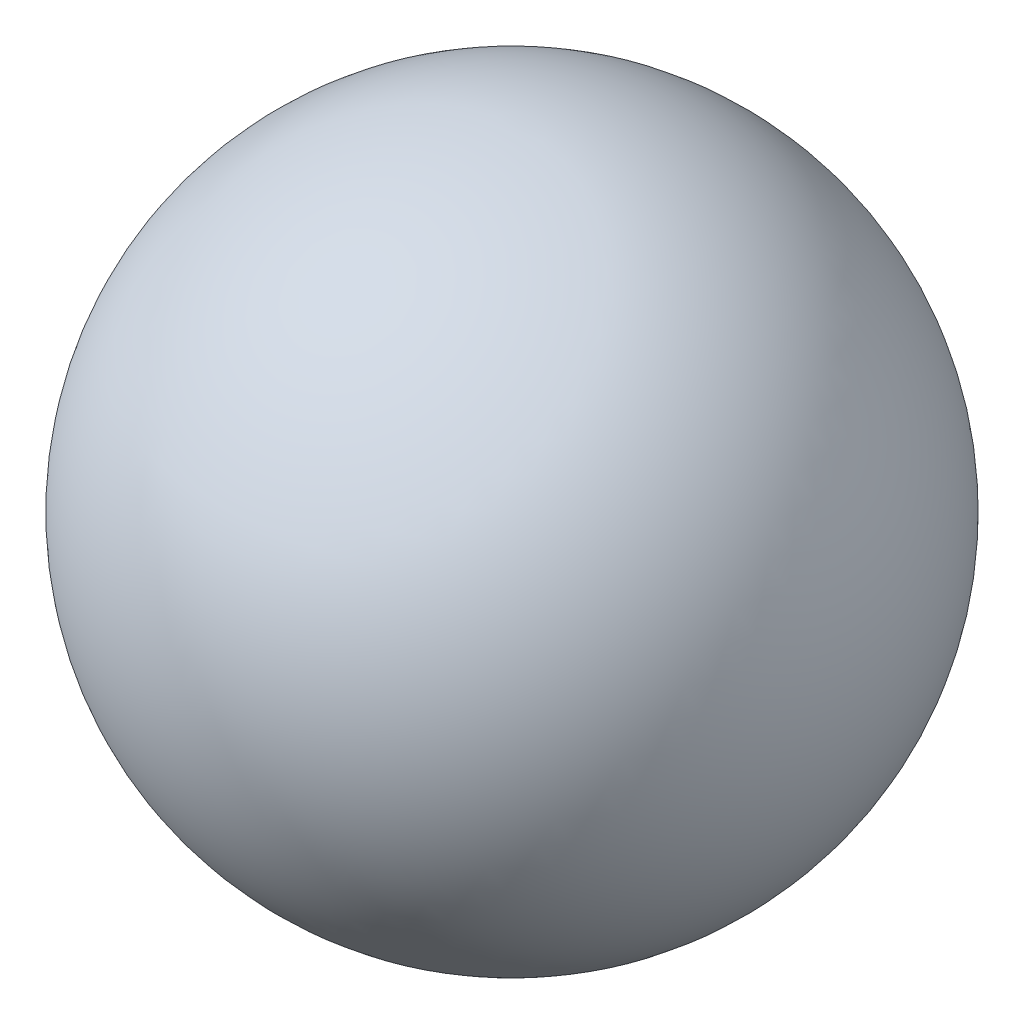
from build123d import *


with BuildPart() as part:
    # Skizze1 → Rotation1 (revolve)
    with BuildSketch(Plane(origin=(0, 0, 0), x_dir=(0, 0, -1), z_dir=(1, 0, 0))):
        with BuildLine():
            ThreePointArc((0, -15), (15, 0), (0, 15))
            Line((0, 15), (0, -15))
        make_face()
    revolve(axis=Axis((0, 15, 0), (0, -1, 0)))


solid = part.part
